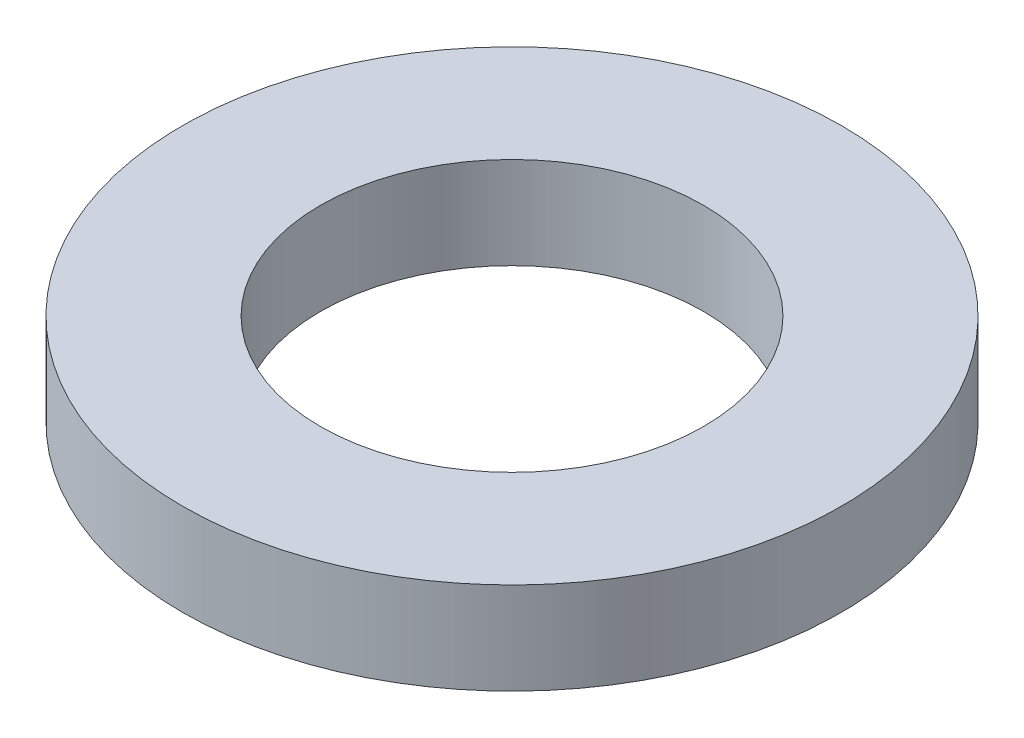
from build123d import *

# Parameters (mm, degrees)
ESQUISSE1_R      = 43
ESQUISSE1_R_2    = 25
EXTRUSION1_DEPTH = 12


with BuildPart() as part:
    # Esquisse1 → Extrusion1 (new body)
    with BuildSketch(Plane(origin=(0, 0, 0), x_dir=(1, 0, 0), z_dir=(0, 1, 0))):
        with Locations(Location((0, 0, 0), (0, 0, 270))):
            Circle(ESQUISSE1_R)
        with Locations(Location((0, 0, 0), (0, 0, 270))):
            Circle(ESQUISSE1_R_2, mode=Mode.SUBTRACT)
    extrude(amount=EXTRUSION1_DEPTH)


solid = part.part
